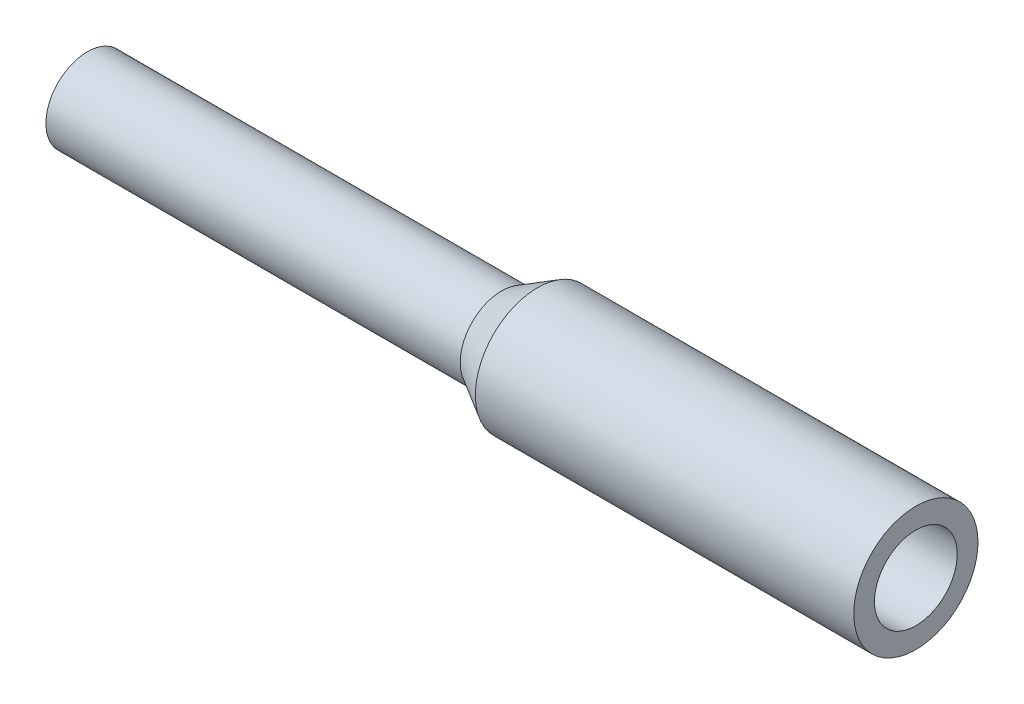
from build123d import *


with BuildPart() as part:
    # Esquisse1 → R_volution1 (revolve)
    with BuildSketch(Plane.XY, mode=Mode.PRIVATE) as r_volution1_sk:
        Polygon((0, 1.5), (-12, 1.5), (-12.901290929, 0), (-30, 0), (-30, 1.5), (-15, 1.5), (-13.700961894, 2.25), (0, 2.25), align=None)
    revolve(r_volution1_sk.sketch.rotate(Axis((0, 0, 0), (-1, 0, 0)), 90), axis=Axis((0, 0, 0), (-1, 0, 0)))


solid = part.part
